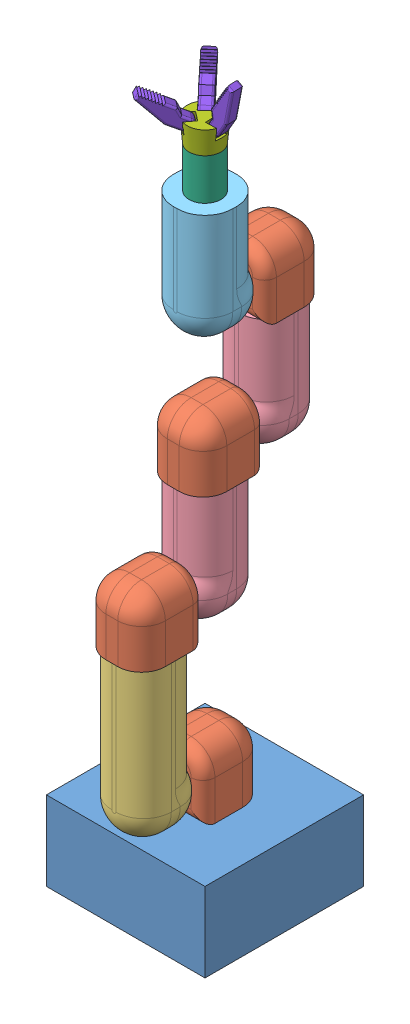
SolidWorks assembly robot_arm.SLDASM, configuration Défaut (file format 13000). Lengths in mm.
Overall size (400 1786.99 470).
14 component instances, 8 part files, 32 mates.
Components (placement in the parent):
- base-1: base.SLDPRT [Défaut] at (303.8116 137.5987 0) size (400 250 400)
- joint-1: joint.SLDPRT [Défaut] at (125 200 120) x (0 0 1) z (-1 0 0) size (210 160 150)
- joint-2: joint.SLDPRT [Défaut] at (275 605 435) x (0 0 -1) z (1 0 0) size (210 160 150)
- joint-3: joint.SLDPRT [Défaut] at (275 910 280) x (0 0 -1) z (1 0 0) size (210 160 150)
- joint-4: joint.SLDPRT [Défaut] at (125 1215 -35) x (0 0 1) z (-1 0 0) size (210 160 150)
- arm-4: arm.SLDPRT [Défaut] at (275 205 430) x (0 0 -1) z (1 0 0) size (150 450 150)
- arm300-4: arm300.SLDPRT [Défaut] at (125 610 125) x (0 0 1) z (-1 0 0) size (150 350 150)
- arm300-5: arm300.SLDPRT [Défaut] at (125 915 -30) x (0 0 1) z (-1 0 0) size (150 350 150)
- arm_end-2: arm_end.SLDPRT [Défaut] at (275 1220 275) x (0 0 -1) z (1 0 0) size (150 300 150)
- grabber_extend-1: grabber_extend.SLDPRT [Défaut] at (200 1423.7896 200) x (0.847677 0 0.530513) z (-0.530513 0 0.847677) size (80 220 80)
- grabber_handler-1: grabber_handler.SLDPRT [Défaut] at (200 1623.7896 200) x (-0.662299 0 -0.74924) z (0.74924 0 -0.662299) size (90.15 60 90.34)
- grip-1: grip.SLDPRT [Défaut] at (168.3189 1673.7896 216.5161) x (0.285028 0.88441 -0.369565) z (0.79185 0 0.610716) size (41.86 130.35 30)
- grip-2: grip.SLDPRT [Défaut] at (232.9101 1673.7896 213.9068) x (-0.863633 0.503291 0.028907) z (-0.033453 0 -0.99944) size (41.86 130.35 30)
- grip-3: grip.SLDPRT [Défaut] at (189.7626 1673.7896 165.7704) x (0.271668 0.912 0.30733) z (-0.74924 0 0.662299) size (41.86 130.35 30)
Mates (geometry in assembly coordinates):
- Coïncidente1: coincident anti-aligned: circle of base-1; circle of joint-1
- Coïncidente11: coincident anti-aligned: circle of joint-1; circle of arm-4
- Coïncidente12: coincident anti-aligned: circle of joint-2; circle of arm-4
- Coïncidente13: coincident anti-aligned: circle of joint-2; circle of arm300-4
- Coïncidente14: coincident anti-aligned: circle of joint-3; circle of arm300-4
- Coïncidente15: coincident anti-aligned: circle of joint-3; circle of arm300-5
- Coïncidente16: coincident anti-aligned: circle of joint-4; circle of arm300-5
- Coïncidente18: coincident anti-aligned: circle of joint-4; circle of arm_end-2
- Coaxiale2: concentric anti-aligned: cylinder of arm_end-2 through (200 1360 200) axis (0 1 0) radius 40; cylinder of grabber_extend-1 through (200 1623.7896 200) axis (0 -1 0) radius 40
- Coïncidente19: coincident anti-aligned: circle of grabber_extend-1; circle of grabbler_handler-1
- Coaxiale3: concentric aligned: cylinder of grabbler_handler-1 through (192.0744 1673.7896 234.8376) axis (-0.79185 0 -0.610716) radius 10; cylinder of grip-1 through (192.0744 1673.7896 234.8376) axis (-0.79185 0 -0.610716) radius 10
- Coïncidente20: coincident anti-aligned: plane of grabbler_handler-1 through (192.0744 1673.7896 234.8376) normal (-0.79185 0 -0.610716); plane of grip-1 through (192.0744 1673.7896 234.8376) normal (0.79185 0 0.610716)
- Coaxiale4: concentric anti-aligned: cylinder of grabbler_handler-1 through (189.7626 1673.7896 165.7704) axis (-0.74924 0 0.662299) radius 10; cylinder of grip-3 through (167.2854 1673.7896 185.6393) axis (0.74924 0 -0.662299) radius 10
- Coïncidente21: coincident anti-aligned: plane of grabbler_handler-1 through (189.7626 1673.7896 165.7704) normal (-0.74924 0 0.662299); plane of grip-3 through (189.7626 1673.7896 165.7704) normal (0.74924 0 -0.662299)
- Coaxiale5: concentric aligned: cylinder of grabbler_handler-1 through (231.9065 1673.7896 183.9236) axis (0.033453 0 0.99944) radius 10; cylinder of grip-2 through (231.9065 1673.7896 183.9236) axis (0.033453 0 0.99944) radius 10
- Coïncidente22: coincident anti-aligned: plane of grabbler_handler-1 through (231.9065 1673.7896 183.9236) normal (0.033453 0 0.99944); plane of grip-2 through (231.9065 1673.7896 183.9236) normal (-0.033453 0 -0.99944)
- DistanceLimite1: limit distance = 63.7896 mm anti-aligned: plane of arm_end-2 through (200 1360 200) normal (0 1 0); plane of grabber_extend-1 through (200 1423.7896 200) normal (0 -1 0)
- AngleLimite10: limit planar angle = 1.570796 rad aligned: plane of arm-4 through (275 205 430) normal (1 0 0); plane of base-1 through (0 200 400) normal (0 1 0)
- AngleLimite33: limit planar angle = 3.627161 rad anti-aligned: plane of grabbler_handler-1 through (200 1683.7896 200) normal (0 1 0); plane of grip-1 through (167.6726 1725.2499 266.4769) normal (0.285028 0.88441 -0.369565)
- AngleLimite31: limit planar angle = 2.718931 rad anti-aligned: plane of grabbler_handler-1 through (200 1683.7896 200) normal (0 1 0); plane of grip-3 through (138.7323 1722.6362 153.3379) normal (0.271668 0.912 0.30733)
- AngleLimite34: limit planar angle = 2.098199 rad anti-aligned: plane of grip-2 through (238.5618 1738.5994 183.7009) normal (-0.863633 0.503291 0.028907); plane of grabbler_handler-1 through (200 1683.7896 200) normal (0 1 0)
- Coïncidente31: coincident anti-aligned: plane of base-1 through (303.8116 137.5987 0) normal (0 0 -1)
- Parallèle9: parallel anti-aligned: plane of base-1 through (0 0 400) normal (0 -1 0)
- Coïncidente34: coincident anti-aligned: plane of base-1 through (0 0 400) normal (0 -1 0)
- Parallèle10: parallel aligned: plane of base-1 through (303.8116 137.5987 0) normal (0 0 -1); plane of joint-1 through (125 360 120) normal (0 0 -1)
- Parallèle11: parallel aligned: plane of base-1 through (0 200 400) normal (-1 0 0); plane of arm-4 through (125 205 280) normal (-1 0 0)
- Parallèle12: parallel aligned: plane of base-1 through (303.8116 137.5987 400) normal (0 0 1); plane of joint-2 through (275 765 435) normal (0 0 1)
- Parallèle13: parallel aligned: plane of base-1 through (0 200 400) normal (-1 0 0); plane of arm300-4 through (125 610 275) normal (-1 0 0)
- Parallèle14: parallel aligned: plane of base-1 through (303.8116 137.5987 400) normal (0 0 1); plane of joint-3 through (275 1070 280) normal (0 0 1)
- Parallèle15: parallel aligned: plane of base-1 through (0 200 400) normal (-1 0 0); plane of arm300-5 through (125 915 120) normal (-1 0 0)
- Parallèle16: parallel aligned: plane of joint-4 through (125 1375 -35) normal (0 0 -1); plane of base-1 through (303.8116 137.5987 0) normal (0 0 -1)
- Parallèle18: parallel aligned: plane of base-1 through (0 200 400) normal (-1 0 0); plane of arm_end-2 through (125 1220 125) normal (-1 0 0)
